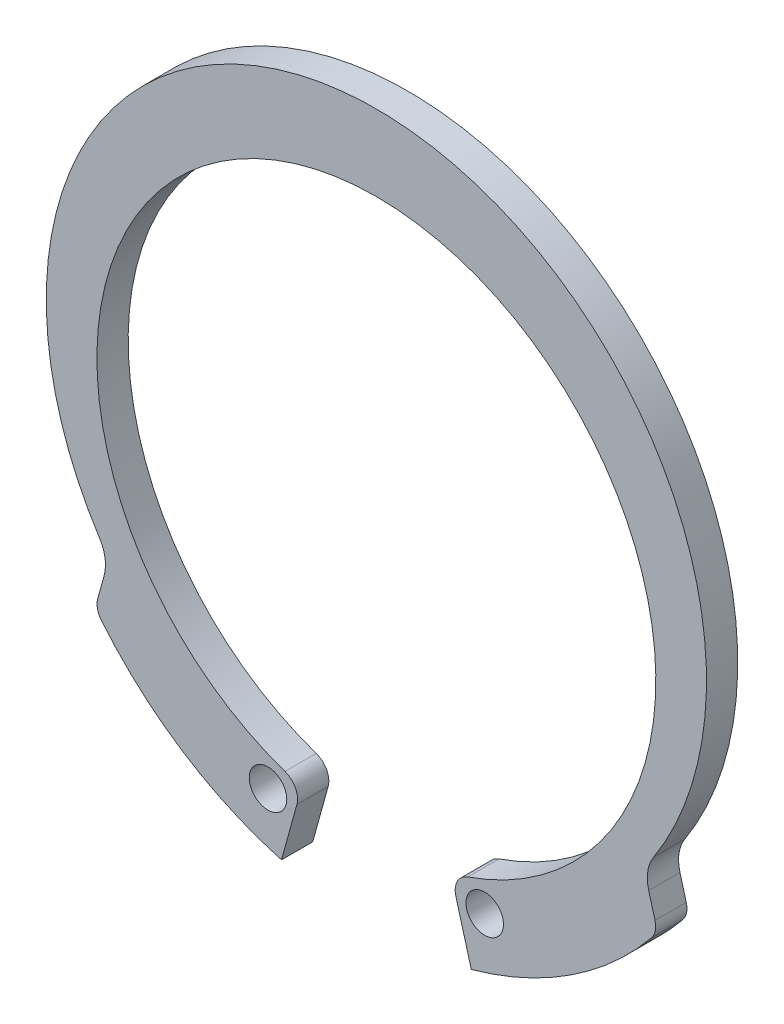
ISO-10303-21;
HEADER;
FILE_DESCRIPTION(('STEP AP214'),'2;1');
FILE_NAME('part.step','',(''),(''),'','','');
FILE_SCHEMA(('AUTOMOTIVE_DESIGN { 1 0 10303 214 1 1 1 1 }'));
ENDSEC;
DATA;
#1=APPLICATION_CONTEXT('core data for automotive mechanical design processes');
#2=APPLICATION_PROTOCOL_DEFINITION('international standard','automotive_design',2000,#1);
#3=PRODUCT_CONTEXT('',#1,'mechanical');
#4=PRODUCT('Part','Part','',(#3));
#5=PRODUCT_RELATED_PRODUCT_CATEGORY('part','',(#4));
#6=PRODUCT_DEFINITION_FORMATION('','',#4);
#7=PRODUCT_DEFINITION_CONTEXT('part definition',#1,'design');
#8=PRODUCT_DEFINITION('design','',#6,#7);
#9=PRODUCT_DEFINITION_SHAPE('','',#8);
#10=(LENGTH_UNIT() NAMED_UNIT(*) SI_UNIT(.MILLI.,.METRE.));
#11=(NAMED_UNIT(*) PLANE_ANGLE_UNIT() SI_UNIT($,.RADIAN.));
#12=(NAMED_UNIT(*) SI_UNIT($,.STERADIAN.) SOLID_ANGLE_UNIT());
#13=UNCERTAINTY_MEASURE_WITH_UNIT(LENGTH_MEASURE(1.E-05),#10,'distance_accuracy_value','');
#14=(GEOMETRIC_REPRESENTATION_CONTEXT(3) GLOBAL_UNCERTAINTY_ASSIGNED_CONTEXT((#13)) GLOBAL_UNIT_ASSIGNED_CONTEXT((#10,
#11,#12)) REPRESENTATION_CONTEXT('',''));
#15=CARTESIAN_POINT('',(0.,0.,0.));
#16=DIRECTION('',(0.,0.,1.));
#17=DIRECTION('',(1.,0.,0.));
#18=AXIS2_PLACEMENT_3D('',#15,#16,#17);
#19=CARTESIAN_POINT('',(0.,0.,-0.888999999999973));
#20=DIRECTION('',(0.,0.,1.));
#21=DIRECTION('',(1.,0.,0.));
#22=AXIS2_PLACEMENT_3D('',#19,#20,#21);
#23=CYLINDRICAL_SURFACE('',#22,10.1092);
#24=CARTESIAN_POINT('',(0.,0.,0.));
#25=DIRECTION('',(0.,0.,1.));
#26=DIRECTION('',(1.,0.,0.));
#27=AXIS2_PLACEMENT_3D('',#24,#25,#26);
#28=CIRCLE('',#27,10.1092);
#29=CARTESIAN_POINT('',(-7.82591514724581,-6.39929501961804,-1.0547118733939E-12));
#30=VERTEX_POINT('',#29);
#31=CARTESIAN_POINT('',(-2.69985738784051,-9.74200670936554,0.));
#32=VERTEX_POINT('',#31);
#33=EDGE_CURVE('E167',#30,#32,#28,.T.);
#34=ORIENTED_EDGE('',*,*,#33,.F.);
#35=DIRECTION('',(0.,0.,1.));
#36=VECTOR('',#35,1.);
#37=CARTESIAN_POINT('',(-7.8259151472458,-6.39929501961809,-0.889000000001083));
#38=LINE('',#37,#36);
#39=CARTESIAN_POINT('',(-7.8259151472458,-6.39929501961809,-0.889000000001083));
#40=VERTEX_POINT('',#39);
#41=EDGE_CURVE('E11',#40,#30,#38,.T.);
#42=ORIENTED_EDGE('',*,*,#41,.F.);
#43=CARTESIAN_POINT('',(0.,0.,-0.888999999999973));
#44=DIRECTION('',(0.,0.,1.));
#45=DIRECTION('',(1.,0.,0.));
#46=AXIS2_PLACEMENT_3D('',#43,#44,#45);
#47=CIRCLE('',#46,10.1092);
#48=CARTESIAN_POINT('',(-2.69985738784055,-9.74200670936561,-0.889000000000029));
#49=VERTEX_POINT('',#48);
#50=EDGE_CURVE('E206',#40,#49,#47,.T.);
#51=ORIENTED_EDGE('',*,*,#50,.T.);
#52=DIRECTION('',(0.,0.,1.));
#53=VECTOR('',#52,1.);
#54=CARTESIAN_POINT('',(-2.69985738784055,-9.74200670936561,-0.889000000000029));
#55=LINE('',#54,#53);
#56=EDGE_CURVE('E37',#49,#32,#55,.T.);
#57=ORIENTED_EDGE('',*,*,#56,.T.);
#58=EDGE_LOOP('',(#34,#42,#51,#57));
#59=FACE_BOUND('',#58,.T.);
#60=ADVANCED_FACE('F34',(#59),#23,.T.);
#61=CARTESIAN_POINT('',(-7.41298997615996,-6.06164377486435,-0.889000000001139));
#62=DIRECTION('',(0.,0.,1.));
#63=DIRECTION('',(1.,0.,0.));
#64=AXIS2_PLACEMENT_3D('',#61,#62,#63);
#65=CYLINDRICAL_SURFACE('',#64,0.533400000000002);
#66=CARTESIAN_POINT('',(-7.41298997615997,-6.06164377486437,-1.0547118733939E-12));
#67=DIRECTION('',(0.,0.,1.));
#68=DIRECTION('',(-1.,0.,0.));
#69=AXIS2_PLACEMENT_3D('',#66,#67,#68);
#70=CIRCLE('',#69,0.533400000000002);
#71=CARTESIAN_POINT('',(-7.92701545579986,-5.91918898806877,-1.0547118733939E-12));
#72=VERTEX_POINT('',#71);
#73=EDGE_CURVE('E204',#72,#30,#70,.T.);
#74=ORIENTED_EDGE('',*,*,#73,.F.);
#75=DIRECTION('',(0.,0.,1.));
#76=VECTOR('',#75,1.);
#77=CARTESIAN_POINT('',(-7.92701545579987,-5.91918898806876,-0.889000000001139));
#78=LINE('',#77,#76);
#79=CARTESIAN_POINT('',(-7.92701545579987,-5.91918898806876,-0.889000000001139));
#80=VERTEX_POINT('',#79);
#81=EDGE_CURVE('E43',#80,#72,#78,.T.);
#82=ORIENTED_EDGE('',*,*,#81,.F.);
#83=CARTESIAN_POINT('',(-7.41298997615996,-6.06164377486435,-0.889000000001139));
#84=DIRECTION('',(0.,0.,1.));
#85=DIRECTION('',(-1.,0.,0.));
#86=AXIS2_PLACEMENT_3D('',#83,#84,#85);
#87=CIRCLE('',#86,0.533400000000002);
#88=EDGE_CURVE('E157',#80,#40,#87,.T.);
#89=ORIENTED_EDGE('',*,*,#88,.T.);
#90=ORIENTED_EDGE('',*,*,#41,.T.);
#91=EDGE_LOOP('',(#74,#82,#89,#90));
#92=FACE_BOUND('',#91,.T.);
#93=ADVANCED_FACE('F230',(#92),#65,.T.);
#94=CARTESIAN_POINT('',(-7.7472865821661,-5.27066588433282,-0.889000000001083));
#95=DIRECTION('',(-0.963677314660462,0.26706934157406,0.));
#96=DIRECTION('',(-0.26706934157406,-0.963677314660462,0.));
#97=AXIS2_PLACEMENT_3D('',#94,#95,#96);
#98=PLANE('',#97);
#99=DIRECTION('',(-0.26706934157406,-0.963677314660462,0.));
#100=VECTOR('',#99,1.);
#101=CARTESIAN_POINT('',(-7.74728658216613,-5.27066588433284,-9.99200722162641E-13));
#102=LINE('',#101,#100);
#103=CARTESIAN_POINT('',(-7.74728658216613,-5.27066588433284,-9.99200722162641E-13));
#104=VERTEX_POINT('',#103);
#105=EDGE_CURVE('E144',#104,#72,#102,.T.);
#106=ORIENTED_EDGE('',*,*,#105,.F.);
#107=DIRECTION('',(0.,0.,1.));
#108=VECTOR('',#107,1.);
#109=CARTESIAN_POINT('',(-7.7472865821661,-5.27066588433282,-0.889000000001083));
#110=LINE('',#109,#108);
#111=CARTESIAN_POINT('',(-7.7472865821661,-5.27066588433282,-0.889000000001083));
#112=VERTEX_POINT('',#111);
#113=EDGE_CURVE('E139',#112,#104,#110,.T.);
#114=ORIENTED_EDGE('',*,*,#113,.F.);
#115=DIRECTION('',(-0.26706934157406,-0.963677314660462,0.));
#116=VECTOR('',#115,1.);
#117=CARTESIAN_POINT('',(-7.7472865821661,-5.27066588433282,-0.889000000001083));
#118=LINE('',#117,#116);
#119=EDGE_CURVE('E142',#112,#80,#118,.T.);
#120=ORIENTED_EDGE('',*,*,#119,.T.);
#121=ORIENTED_EDGE('',*,*,#81,.T.);
#122=EDGE_LOOP('',(#106,#114,#120,#121));
#123=FACE_BOUND('',#122,.T.);
#124=ADVANCED_FACE('F141',(#123),#98,.T.);
#125=CARTESIAN_POINT('',(-8.79772647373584,-4.97955153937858,-0.889000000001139));
#126=DIRECTION('',(0.,0.,1.));
#127=DIRECTION('',(1.,0.,0.));
#128=AXIS2_PLACEMENT_3D('',#125,#126,#127);
#129=CYLINDRICAL_SURFACE('',#128,1.09003281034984);
#130=CARTESIAN_POINT('',(-8.79772647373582,-4.97955153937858,-1.0547118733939E-12));
#131=DIRECTION('',(0.,0.,-1.));
#132=DIRECTION('',(1.,0.,0.));
#133=AXIS2_PLACEMENT_3D('',#130,#131,#132);
#134=CIRCLE('',#133,1.09003281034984);
#135=CARTESIAN_POINT('',(-7.88279161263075,-4.38704354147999,-1.11022302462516E-12));
#136=VERTEX_POINT('',#135);
#137=EDGE_CURVE('E201',#136,#104,#134,.T.);
#138=ORIENTED_EDGE('',*,*,#137,.F.);
#139=DIRECTION('',(0.,0.,1.));
#140=VECTOR('',#139,1.);
#141=CARTESIAN_POINT('',(-7.88279161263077,-4.38704354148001,-0.889000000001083));
#142=LINE('',#141,#140);
#143=CARTESIAN_POINT('',(-7.88279161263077,-4.38704354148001,-0.889000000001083));
#144=VERTEX_POINT('',#143);
#145=EDGE_CURVE('E149',#144,#136,#142,.T.);
#146=ORIENTED_EDGE('',*,*,#145,.F.);
#147=CARTESIAN_POINT('',(-8.79772647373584,-4.97955153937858,-0.889000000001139));
#148=DIRECTION('',(0.,0.,-1.));
#149=DIRECTION('',(1.,0.,0.));
#150=AXIS2_PLACEMENT_3D('',#147,#148,#149);
#151=CIRCLE('',#150,1.09003281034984);
#152=EDGE_CURVE('E155',#144,#112,#151,.T.);
#153=ORIENTED_EDGE('',*,*,#152,.T.);
#154=ORIENTED_EDGE('',*,*,#113,.T.);
#155=EDGE_LOOP('',(#138,#146,#153,#154));
#156=FACE_BOUND('',#155,.T.);
#157=ADVANCED_FACE('F159',(#156),#129,.F.);
#158=CARTESIAN_POINT('',(0.,0.717819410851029,-0.889000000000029));
#159=DIRECTION('',(0.,0.,1.));
#160=DIRECTION('',(1.,0.,0.));
#161=AXIS2_PLACEMENT_3D('',#158,#159,#160);
#162=CYLINDRICAL_SURFACE('',#161,9.39138058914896);
#163=CARTESIAN_POINT('',(0.,0.717819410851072,0.));
#164=DIRECTION('',(0.,0.,1.));
#165=DIRECTION('',(1.,0.,0.));
#166=AXIS2_PLACEMENT_3D('',#163,#164,#165);
#167=CIRCLE('',#166,9.39138058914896);
#168=CARTESIAN_POINT('',(7.88279161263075,-4.38704354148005,0.));
#169=VERTEX_POINT('',#168);
#170=EDGE_CURVE('E198',#169,#136,#167,.T.);
#171=ORIENTED_EDGE('',*,*,#170,.F.);
#172=DIRECTION('',(0.,0.,1.));
#173=VECTOR('',#172,1.);
#174=CARTESIAN_POINT('',(7.88279161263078,-4.38704354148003,-0.889000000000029));
#175=LINE('',#174,#173);
#176=CARTESIAN_POINT('',(7.88279161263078,-4.38704354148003,-0.889000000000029));
#177=VERTEX_POINT('',#176);
#178=EDGE_CURVE('E210',#177,#169,#175,.T.);
#179=ORIENTED_EDGE('',*,*,#178,.F.);
#180=CARTESIAN_POINT('',(0.,0.717819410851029,-0.889000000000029));
#181=DIRECTION('',(0.,0.,1.));
#182=DIRECTION('',(1.,0.,0.));
#183=AXIS2_PLACEMENT_3D('',#180,#181,#182);
#184=CIRCLE('',#183,9.39138058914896);
#185=EDGE_CURVE('E160',#177,#144,#184,.T.);
#186=ORIENTED_EDGE('',*,*,#185,.T.);
#187=ORIENTED_EDGE('',*,*,#145,.T.);
#188=EDGE_LOOP('',(#171,#179,#186,#187));
#189=FACE_BOUND('',#188,.T.);
#190=ADVANCED_FACE('F243',(#189),#162,.T.);
#191=CARTESIAN_POINT('',(8.79772647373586,-4.9795515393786,-0.888999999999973));
#192=DIRECTION('',(0.,0.,1.));
#193=DIRECTION('',(1.,0.,0.));
#194=AXIS2_PLACEMENT_3D('',#191,#192,#193);
#195=CYLINDRICAL_SURFACE('',#194,1.09003281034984);
#196=CARTESIAN_POINT('',(8.79772647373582,-4.97955153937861,0.));
#197=DIRECTION('',(0.,0.,-1.));
#198=DIRECTION('',(1.,0.,0.));
#199=AXIS2_PLACEMENT_3D('',#196,#197,#198);
#200=CIRCLE('',#199,1.09003281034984);
#201=CARTESIAN_POINT('',(7.74728658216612,-5.27066588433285,0.));
#202=VERTEX_POINT('',#201);
#203=EDGE_CURVE('E195',#202,#169,#200,.T.);
#204=ORIENTED_EDGE('',*,*,#203,.F.);
#205=DIRECTION('',(0.,0.,1.));
#206=VECTOR('',#205,1.);
#207=CARTESIAN_POINT('',(7.74728658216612,-5.27066588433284,-0.889000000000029));
#208=LINE('',#207,#206);
#209=CARTESIAN_POINT('',(7.74728658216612,-5.27066588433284,-0.889000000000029));
#210=VERTEX_POINT('',#209);
#211=EDGE_CURVE('E212',#210,#202,#208,.T.);
#212=ORIENTED_EDGE('',*,*,#211,.F.);
#213=CARTESIAN_POINT('',(8.79772647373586,-4.9795515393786,-0.888999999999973));
#214=DIRECTION('',(0.,0.,-1.));
#215=DIRECTION('',(1.,0.,0.));
#216=AXIS2_PLACEMENT_3D('',#213,#214,#215);
#217=CIRCLE('',#216,1.09003281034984);
#218=EDGE_CURVE('E162',#210,#177,#217,.T.);
#219=ORIENTED_EDGE('',*,*,#218,.T.);
#220=ORIENTED_EDGE('',*,*,#178,.T.);
#221=EDGE_LOOP('',(#204,#212,#219,#220));
#222=FACE_BOUND('',#221,.T.);
#223=ADVANCED_FACE('F246',(#222),#195,.F.);
#224=CARTESIAN_POINT('',(7.74728658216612,-5.27066588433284,-0.889000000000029));
#225=DIRECTION('',(0.963677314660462,0.26706934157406,0.));
#226=DIRECTION('',(-0.26706934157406,0.963677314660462,0.));
#227=AXIS2_PLACEMENT_3D('',#224,#225,#226);
#228=PLANE('',#227);
#229=DIRECTION('',(-0.26706934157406,0.963677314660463,0.));
#230=VECTOR('',#229,1.);
#231=CARTESIAN_POINT('',(7.74728658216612,-5.27066588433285,0.));
#232=LINE('',#231,#230);
#233=CARTESIAN_POINT('',(7.92701545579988,-5.91918898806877,0.));
#234=VERTEX_POINT('',#233);
#235=EDGE_CURVE('E192',#234,#202,#232,.T.);
#236=ORIENTED_EDGE('',*,*,#235,.F.);
#237=DIRECTION('',(0.,0.,1.));
#238=VECTOR('',#237,1.);
#239=CARTESIAN_POINT('',(7.92701545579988,-5.91918898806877,-0.889000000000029));
#240=LINE('',#239,#238);
#241=CARTESIAN_POINT('',(7.92701545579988,-5.91918898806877,-0.889000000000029));
#242=VERTEX_POINT('',#241);
#243=EDGE_CURVE('E214',#242,#234,#240,.T.);
#244=ORIENTED_EDGE('',*,*,#243,.F.);
#245=DIRECTION('',(-0.26706934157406,0.963677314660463,0.));
#246=VECTOR('',#245,1.);
#247=CARTESIAN_POINT('',(7.74728658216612,-5.27066588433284,-0.889000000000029));
#248=LINE('',#247,#246);
#249=EDGE_CURVE('E334',#242,#210,#248,.T.);
#250=ORIENTED_EDGE('',*,*,#249,.T.);
#251=ORIENTED_EDGE('',*,*,#211,.T.);
#252=EDGE_LOOP('',(#236,#244,#250,#251));
#253=FACE_BOUND('',#252,.T.);
#254=ADVANCED_FACE('F250',(#253),#228,.T.);
#255=CARTESIAN_POINT('',(7.41298997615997,-6.06164377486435,-0.889000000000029));
#256=DIRECTION('',(0.,0.,1.));
#257=DIRECTION('',(1.,0.,0.));
#258=AXIS2_PLACEMENT_3D('',#255,#256,#257);
#259=CYLINDRICAL_SURFACE('',#258,0.533400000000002);
#260=CARTESIAN_POINT('',(7.41298997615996,-6.06164377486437,0.));
#261=DIRECTION('',(0.,0.,1.));
#262=DIRECTION('',(1.,0.,0.));
#263=AXIS2_PLACEMENT_3D('',#260,#261,#262);
#264=CIRCLE('',#263,0.533400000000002);
#265=CARTESIAN_POINT('',(7.82591514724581,-6.3992950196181,0.));
#266=VERTEX_POINT('',#265);
#267=EDGE_CURVE('E189',#266,#234,#264,.T.);
#268=ORIENTED_EDGE('',*,*,#267,.F.);
#269=DIRECTION('',(0.,0.,1.));
#270=VECTOR('',#269,1.);
#271=CARTESIAN_POINT('',(7.8259151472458,-6.39929501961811,-0.889000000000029));
#272=LINE('',#271,#270);
#273=CARTESIAN_POINT('',(7.8259151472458,-6.39929501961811,-0.889000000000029));
#274=VERTEX_POINT('',#273);
#275=EDGE_CURVE('E216',#274,#266,#272,.T.);
#276=ORIENTED_EDGE('',*,*,#275,.F.);
#277=CARTESIAN_POINT('',(7.41298997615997,-6.06164377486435,-0.889000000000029));
#278=DIRECTION('',(0.,0.,1.));
#279=DIRECTION('',(1.,0.,0.));
#280=AXIS2_PLACEMENT_3D('',#277,#278,#279);
#281=CIRCLE('',#280,0.533400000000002);
#282=EDGE_CURVE('E331',#274,#242,#281,.T.);
#283=ORIENTED_EDGE('',*,*,#282,.T.);
#284=ORIENTED_EDGE('',*,*,#243,.T.);
#285=EDGE_LOOP('',(#268,#276,#283,#284));
#286=FACE_BOUND('',#285,.T.);
#287=ADVANCED_FACE('F254',(#286),#259,.T.);
#288=CARTESIAN_POINT('',(0.,0.,-0.888999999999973));
#289=DIRECTION('',(0.,0.,1.));
#290=DIRECTION('',(1.,0.,0.));
#291=AXIS2_PLACEMENT_3D('',#288,#289,#290);
#292=CYLINDRICAL_SURFACE('',#291,10.1092);
#293=CARTESIAN_POINT('',(0.,0.,0.));
#294=DIRECTION('',(0.,0.,1.));
#295=DIRECTION('',(1.,0.,0.));
#296=AXIS2_PLACEMENT_3D('',#293,#294,#295);
#297=CIRCLE('',#296,10.1092);
#298=CARTESIAN_POINT('',(2.6998573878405,-9.74200670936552,0.));
#299=VERTEX_POINT('',#298);
#300=EDGE_CURVE('E186',#299,#266,#297,.T.);
#301=ORIENTED_EDGE('',*,*,#300,.F.);
#302=DIRECTION('',(0.,0.,1.));
#303=VECTOR('',#302,1.);
#304=CARTESIAN_POINT('',(2.69985738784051,-9.74200670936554,-0.888999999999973));
#305=LINE('',#304,#303);
#306=CARTESIAN_POINT('',(2.69985738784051,-9.74200670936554,-0.888999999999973));
#307=VERTEX_POINT('',#306);
#308=EDGE_CURVE('E218',#307,#299,#305,.T.);
#309=ORIENTED_EDGE('',*,*,#308,.F.);
#310=CARTESIAN_POINT('',(0.,0.,-0.888999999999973));
#311=DIRECTION('',(0.,0.,1.));
#312=DIRECTION('',(1.,0.,0.));
#313=AXIS2_PLACEMENT_3D('',#310,#311,#312);
#314=CIRCLE('',#313,10.1092);
#315=EDGE_CURVE('E328',#307,#274,#314,.T.);
#316=ORIENTED_EDGE('',*,*,#315,.T.);
#317=ORIENTED_EDGE('',*,*,#275,.T.);
#318=EDGE_LOOP('',(#301,#309,#316,#317));
#319=FACE_BOUND('',#318,.T.);
#320=ADVANCED_FACE('F258',(#319),#292,.T.);
#321=CARTESIAN_POINT('',(2.2612266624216,-8.15927738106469,-0.888999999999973));
#322=DIRECTION('',(-0.963677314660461,-0.267069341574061,0.));
#323=DIRECTION('',(0.267069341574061,-0.963677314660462,0.));
#324=AXIS2_PLACEMENT_3D('',#321,#322,#323);
#325=PLANE('',#324);
#326=DIRECTION('',(0.267069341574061,-0.963677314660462,0.));
#327=VECTOR('',#326,1.);
#328=CARTESIAN_POINT('',(2.26122666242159,-8.1592773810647,0.));
#329=LINE('',#328,#327);
#330=CARTESIAN_POINT('',(2.26122666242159,-8.1592773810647,0.));
#331=VERTEX_POINT('',#330);
#332=EDGE_CURVE('E183',#331,#299,#329,.T.);
#333=ORIENTED_EDGE('',*,*,#332,.F.);
#334=DIRECTION('',(0.,0.,1.));
#335=VECTOR('',#334,1.);
#336=CARTESIAN_POINT('',(2.2612266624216,-8.15927738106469,-0.888999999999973));
#337=LINE('',#336,#335);
#338=CARTESIAN_POINT('',(2.2612266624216,-8.15927738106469,-0.888999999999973));
#339=VERTEX_POINT('',#338);
#340=EDGE_CURVE('E220',#339,#331,#337,.T.);
#341=ORIENTED_EDGE('',*,*,#340,.F.);
#342=DIRECTION('',(0.267069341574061,-0.963677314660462,0.));
#343=VECTOR('',#342,1.);
#344=CARTESIAN_POINT('',(2.2612266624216,-8.15927738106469,-0.888999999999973));
#345=LINE('',#344,#343);
#346=EDGE_CURVE('E325',#339,#307,#345,.T.);
#347=ORIENTED_EDGE('',*,*,#346,.T.);
#348=ORIENTED_EDGE('',*,*,#308,.T.);
#349=EDGE_LOOP('',(#333,#341,#347,#348));
#350=FACE_BOUND('',#349,.T.);
#351=ADVANCED_FACE('F262',(#350),#325,.T.);
#352=CARTESIAN_POINT('',(2.77525214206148,-8.01682259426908,-0.888999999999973));
#353=DIRECTION('',(0.,0.,1.));
#354=DIRECTION('',(1.,0.,0.));
#355=AXIS2_PLACEMENT_3D('',#352,#353,#354);
#356=CYLINDRICAL_SURFACE('',#355,0.5334);
#357=CARTESIAN_POINT('',(2.7752521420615,-8.01682259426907,0.));
#358=DIRECTION('',(0.,0.,1.));
#359=DIRECTION('',(-1.,0.,0.));
#360=AXIS2_PLACEMENT_3D('',#357,#358,#359);
#361=CIRCLE('',#360,0.5334);
#362=CARTESIAN_POINT('',(2.60076024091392,-7.51277087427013,0.));
#363=VERTEX_POINT('',#362);
#364=EDGE_CURVE('E180',#363,#331,#361,.T.);
#365=ORIENTED_EDGE('',*,*,#364,.F.);
#366=DIRECTION('',(0.,0.,1.));
#367=VECTOR('',#366,1.);
#368=CARTESIAN_POINT('',(2.60076024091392,-7.51277087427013,-0.888999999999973));
#369=LINE('',#368,#367);
#370=CARTESIAN_POINT('',(2.60076024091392,-7.51277087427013,-0.888999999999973));
#371=VERTEX_POINT('',#370);
#372=EDGE_CURVE('E222',#371,#363,#369,.T.);
#373=ORIENTED_EDGE('',*,*,#372,.F.);
#374=CARTESIAN_POINT('',(2.77525214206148,-8.01682259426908,-0.888999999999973));
#375=DIRECTION('',(0.,0.,1.));
#376=DIRECTION('',(-1.,0.,0.));
#377=AXIS2_PLACEMENT_3D('',#374,#375,#376);
#378=CIRCLE('',#377,0.5334);
#379=EDGE_CURVE('E322',#371,#339,#378,.T.);
#380=ORIENTED_EDGE('',*,*,#379,.T.);
#381=ORIENTED_EDGE('',*,*,#340,.T.);
#382=EDGE_LOOP('',(#365,#373,#380,#381));
#383=FACE_BOUND('',#382,.T.);
#384=ADVANCED_FACE('F266',(#383),#356,.T.);
#385=CARTESIAN_POINT('',(0.,0.,-0.888999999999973));
#386=DIRECTION('',(0.,0.,1.));
#387=DIRECTION('',(1.,0.,0.));
#388=AXIS2_PLACEMENT_3D('',#385,#386,#387);
#389=CYLINDRICAL_SURFACE('',#388,7.9502);
#390=CARTESIAN_POINT('',(0.,0.,0.));
#391=DIRECTION('',(0.,0.,-1.));
#392=DIRECTION('',(1.,0.,0.));
#393=AXIS2_PLACEMENT_3D('',#390,#391,#392);
#394=CIRCLE('',#393,7.9502);
#395=CARTESIAN_POINT('',(-2.60076024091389,-7.51277087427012,0.));
#396=VERTEX_POINT('',#395);
#397=EDGE_CURVE('E177',#396,#363,#394,.T.);
#398=ORIENTED_EDGE('',*,*,#397,.F.);
#399=DIRECTION('',(0.,0.,1.));
#400=VECTOR('',#399,1.);
#401=CARTESIAN_POINT('',(-2.60076024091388,-7.51277087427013,-0.888999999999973));
#402=LINE('',#401,#400);
#403=CARTESIAN_POINT('',(-2.60076024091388,-7.51277087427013,-0.888999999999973));
#404=VERTEX_POINT('',#403);
#405=EDGE_CURVE('E224',#404,#396,#402,.T.);
#406=ORIENTED_EDGE('',*,*,#405,.F.);
#407=CARTESIAN_POINT('',(0.,0.,-0.888999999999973));
#408=DIRECTION('',(0.,0.,-1.));
#409=DIRECTION('',(1.,0.,0.));
#410=AXIS2_PLACEMENT_3D('',#407,#408,#409);
#411=CIRCLE('',#410,7.9502);
#412=EDGE_CURVE('E319',#404,#371,#411,.T.);
#413=ORIENTED_EDGE('',*,*,#412,.T.);
#414=ORIENTED_EDGE('',*,*,#372,.T.);
#415=EDGE_LOOP('',(#398,#406,#413,#414));
#416=FACE_BOUND('',#415,.T.);
#417=ADVANCED_FACE('F270',(#416),#389,.F.);
#418=CARTESIAN_POINT('',(-2.77525214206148,-8.01682259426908,-0.888999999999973));
#419=DIRECTION('',(0.,0.,1.));
#420=DIRECTION('',(1.,0.,0.));
#421=AXIS2_PLACEMENT_3D('',#418,#419,#420);
#422=CYLINDRICAL_SURFACE('',#421,0.5334);
#423=CARTESIAN_POINT('',(-2.77525214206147,-8.01682259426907,0.));
#424=DIRECTION('',(0.,0.,1.));
#425=DIRECTION('',(1.,0.,0.));
#426=AXIS2_PLACEMENT_3D('',#423,#424,#425);
#427=CIRCLE('',#426,0.5334);
#428=CARTESIAN_POINT('',(-2.2612266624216,-8.15927738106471,0.));
#429=VERTEX_POINT('',#428);
#430=EDGE_CURVE('E174',#429,#396,#427,.T.);
#431=ORIENTED_EDGE('',*,*,#430,.F.);
#432=DIRECTION('',(0.,0.,1.));
#433=VECTOR('',#432,1.);
#434=CARTESIAN_POINT('',(-2.26122666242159,-8.1592773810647,-0.888999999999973));
#435=LINE('',#434,#433);
#436=CARTESIAN_POINT('',(-2.26122666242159,-8.1592773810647,-0.888999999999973));
#437=VERTEX_POINT('',#436);
#438=EDGE_CURVE('E225',#437,#429,#435,.T.);
#439=ORIENTED_EDGE('',*,*,#438,.F.);
#440=CARTESIAN_POINT('',(-2.77525214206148,-8.01682259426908,-0.888999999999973));
#441=DIRECTION('',(0.,0.,1.));
#442=DIRECTION('',(1.,0.,0.));
#443=AXIS2_PLACEMENT_3D('',#440,#441,#442);
#444=CIRCLE('',#443,0.5334);
#445=EDGE_CURVE('E316',#437,#404,#444,.T.);
#446=ORIENTED_EDGE('',*,*,#445,.T.);
#447=ORIENTED_EDGE('',*,*,#405,.T.);
#448=EDGE_LOOP('',(#431,#439,#446,#447));
#449=FACE_BOUND('',#448,.T.);
#450=ADVANCED_FACE('F274',(#449),#422,.T.);
#451=CARTESIAN_POINT('',(-2.26122666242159,-8.1592773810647,-0.888999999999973));
#452=DIRECTION('',(0.963677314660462,-0.267069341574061,0.));
#453=DIRECTION('',(0.267069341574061,0.963677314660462,0.));
#454=AXIS2_PLACEMENT_3D('',#451,#452,#453);
#455=PLANE('',#454);
#456=DIRECTION('',(0.267069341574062,0.963677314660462,0.));
#457=VECTOR('',#456,1.);
#458=CARTESIAN_POINT('',(-2.2612266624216,-8.15927738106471,0.));
#459=LINE('',#458,#457);
#460=EDGE_CURVE('E170',#32,#429,#459,.T.);
#461=ORIENTED_EDGE('',*,*,#460,.F.);
#462=ORIENTED_EDGE('',*,*,#56,.F.);
#463=DIRECTION('',(0.267069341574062,0.963677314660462,0.));
#464=VECTOR('',#463,1.);
#465=CARTESIAN_POINT('',(-2.26122666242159,-8.1592773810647,-0.888999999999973));
#466=LINE('',#465,#464);
#467=EDGE_CURVE('E314',#49,#437,#466,.T.);
#468=ORIENTED_EDGE('',*,*,#467,.T.);
#469=ORIENTED_EDGE('',*,*,#438,.T.);
#470=EDGE_LOOP('',(#461,#462,#468,#469));
#471=FACE_BOUND('',#470,.T.);
#472=ADVANCED_FACE('F227',(#471),#455,.T.);
#473=CARTESIAN_POINT('',(0.,0.,-0.888999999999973));
#474=DIRECTION('',(0.,0.,1.));
#475=DIRECTION('',(1.,0.,0.));
#476=AXIS2_PLACEMENT_3D('',#473,#474,#475);
#477=PLANE('',#476);
#478=CARTESIAN_POINT('',(-3.08284998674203,-8.17567671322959,-0.888999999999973));
#479=DIRECTION('',(0.,0.,1.));
#480=DIRECTION('',(1.,0.,0.));
#481=AXIS2_PLACEMENT_3D('',#478,#479,#480);
#482=CIRCLE('',#481,0.533400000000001);
#483=CARTESIAN_POINT('',(-2.54944998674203,-8.17567671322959,-0.888999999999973));
#484=VERTEX_POINT('',#483);
#485=EDGE_CURVE('E301',#484,#484,#482,.T.);
#486=ORIENTED_EDGE('',*,*,#485,.T.);
#487=EDGE_LOOP('',(#486));
#488=FACE_BOUND('',#487,.T.);
#489=CARTESIAN_POINT('',(3.08284998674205,-8.17567671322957,-0.888999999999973));
#490=DIRECTION('',(0.,0.,1.));
#491=DIRECTION('',(1.,0.,0.));
#492=AXIS2_PLACEMENT_3D('',#489,#490,#491);
#493=CIRCLE('',#492,0.533400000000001);
#494=CARTESIAN_POINT('',(3.61624998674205,-8.17567671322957,-0.888999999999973));
#495=VERTEX_POINT('',#494);
#496=EDGE_CURVE('E171',#495,#495,#493,.T.);
#497=ORIENTED_EDGE('',*,*,#496,.T.);
#498=EDGE_LOOP('',(#497));
#499=FACE_BOUND('',#498,.T.);
#500=ORIENTED_EDGE('',*,*,#50,.F.);
#501=ORIENTED_EDGE('',*,*,#88,.F.);
#502=ORIENTED_EDGE('',*,*,#119,.F.);
#503=ORIENTED_EDGE('',*,*,#152,.F.);
#504=ORIENTED_EDGE('',*,*,#185,.F.);
#505=ORIENTED_EDGE('',*,*,#218,.F.);
#506=ORIENTED_EDGE('',*,*,#249,.F.);
#507=ORIENTED_EDGE('',*,*,#282,.F.);
#508=ORIENTED_EDGE('',*,*,#315,.F.);
#509=ORIENTED_EDGE('',*,*,#346,.F.);
#510=ORIENTED_EDGE('',*,*,#379,.F.);
#511=ORIENTED_EDGE('',*,*,#412,.F.);
#512=ORIENTED_EDGE('',*,*,#445,.F.);
#513=ORIENTED_EDGE('',*,*,#467,.F.);
#514=EDGE_LOOP('',(#500,#501,#502,#503,#504,#505,#506,#507,#508,#509,#510,#511,#512,#513));
#515=FACE_BOUND('',#514,.T.);
#516=ADVANCED_FACE('F153',(#488,#499,#515),#477,.F.);
#517=CARTESIAN_POINT('',(0.,0.,0.));
#518=DIRECTION('',(0.,0.,1.));
#519=DIRECTION('',(1.,0.,0.));
#520=AXIS2_PLACEMENT_3D('',#517,#518,#519);
#521=PLANE('',#520);
#522=CARTESIAN_POINT('',(-3.08284998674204,-8.17567671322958,0.));
#523=DIRECTION('',(0.,0.,1.));
#524=DIRECTION('',(1.,0.,0.));
#525=AXIS2_PLACEMENT_3D('',#522,#523,#524);
#526=CIRCLE('',#525,0.533400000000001);
#527=CARTESIAN_POINT('',(-2.54944998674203,-8.17567671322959,0.));
#528=VERTEX_POINT('',#527);
#529=EDGE_CURVE('E304',#528,#528,#526,.T.);
#530=ORIENTED_EDGE('',*,*,#529,.F.);
#531=EDGE_LOOP('',(#530));
#532=FACE_BOUND('',#531,.T.);
#533=CARTESIAN_POINT('',(3.08284998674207,-8.17567671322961,0.));
#534=DIRECTION('',(0.,0.,1.));
#535=DIRECTION('',(1.,0.,0.));
#536=AXIS2_PLACEMENT_3D('',#533,#534,#535);
#537=CIRCLE('',#536,0.533400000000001);
#538=CARTESIAN_POINT('',(3.61624998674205,-8.17567671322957,0.));
#539=VERTEX_POINT('',#538);
#540=EDGE_CURVE('E306',#539,#539,#537,.T.);
#541=ORIENTED_EDGE('',*,*,#540,.F.);
#542=EDGE_LOOP('',(#541));
#543=FACE_BOUND('',#542,.T.);
#544=ORIENTED_EDGE('',*,*,#33,.T.);
#545=ORIENTED_EDGE('',*,*,#460,.T.);
#546=ORIENTED_EDGE('',*,*,#430,.T.);
#547=ORIENTED_EDGE('',*,*,#397,.T.);
#548=ORIENTED_EDGE('',*,*,#364,.T.);
#549=ORIENTED_EDGE('',*,*,#332,.T.);
#550=ORIENTED_EDGE('',*,*,#300,.T.);
#551=ORIENTED_EDGE('',*,*,#267,.T.);
#552=ORIENTED_EDGE('',*,*,#235,.T.);
#553=ORIENTED_EDGE('',*,*,#203,.T.);
#554=ORIENTED_EDGE('',*,*,#170,.T.);
#555=ORIENTED_EDGE('',*,*,#137,.T.);
#556=ORIENTED_EDGE('',*,*,#105,.T.);
#557=ORIENTED_EDGE('',*,*,#73,.T.);
#558=EDGE_LOOP('',(#544,#545,#546,#547,#548,#549,#550,#551,#552,#553,#554,#555,#556,#557));
#559=FACE_BOUND('',#558,.T.);
#560=ADVANCED_FACE('F229',(#532,#543,#559),#521,.T.);
#561=CARTESIAN_POINT('',(3.08284998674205,-8.17567671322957,-0.888999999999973));
#562=DIRECTION('',(0.,0.,1.));
#563=DIRECTION('',(1.,0.,0.));
#564=AXIS2_PLACEMENT_3D('',#561,#562,#563);
#565=CYLINDRICAL_SURFACE('',#564,0.533400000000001);
#566=CARTESIAN_POINT('',(3.61624998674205,-8.17567671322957,-0.888999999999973));
#567=CARTESIAN_POINT('',(3.61624998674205,-8.17567671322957,-0.879739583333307));
#568=CARTESIAN_POINT('',(3.61624998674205,-8.17567671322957,-0.87047916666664));
#569=CARTESIAN_POINT('',(3.61624998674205,-8.17567671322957,-0.851958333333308));
#570=CARTESIAN_POINT('',(3.61624998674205,-8.17567671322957,-0.842697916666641));
#571=CARTESIAN_POINT('',(3.61624998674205,-8.17567671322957,-0.824177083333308));
#572=CARTESIAN_POINT('',(3.61624998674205,-8.17567671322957,-0.814916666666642));
#573=CARTESIAN_POINT('',(3.61624998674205,-8.17567671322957,-0.796395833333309));
#574=CARTESIAN_POINT('',(3.61624998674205,-8.17567671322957,-0.787135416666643));
#575=CARTESIAN_POINT('',(3.61624998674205,-8.17567671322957,-0.76861458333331));
#576=CARTESIAN_POINT('',(3.61624998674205,-8.17567671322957,-0.759354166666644));
#577=CARTESIAN_POINT('',(3.61624998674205,-8.17567671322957,-0.740833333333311));
#578=CARTESIAN_POINT('',(3.61624998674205,-8.17567671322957,-0.731572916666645));
#579=CARTESIAN_POINT('',(3.61624998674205,-8.17567671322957,-0.713052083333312));
#580=CARTESIAN_POINT('',(3.61624998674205,-8.17567671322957,-0.703791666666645));
#581=CARTESIAN_POINT('',(3.61624998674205,-8.17567671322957,-0.685270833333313));
#582=CARTESIAN_POINT('',(3.61624998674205,-8.17567671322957,-0.676010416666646));
#583=CARTESIAN_POINT('',(3.61624998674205,-8.17567671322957,-0.657489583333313));
#584=CARTESIAN_POINT('',(3.61624998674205,-8.17567671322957,-0.648229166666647));
#585=CARTESIAN_POINT('',(3.61624998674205,-8.17567671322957,-0.629708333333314));
#586=CARTESIAN_POINT('',(3.61624998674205,-8.17567671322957,-0.620447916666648));
#587=CARTESIAN_POINT('',(3.61624998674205,-8.17567671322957,-0.601927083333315));
#588=CARTESIAN_POINT('',(3.61624998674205,-8.17567671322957,-0.592666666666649));
#589=CARTESIAN_POINT('',(3.61624998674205,-8.17567671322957,-0.574145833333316));
#590=CARTESIAN_POINT('',(3.61624998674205,-8.17567671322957,-0.56488541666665));
#591=CARTESIAN_POINT('',(3.61624998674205,-8.17567671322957,-0.546364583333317));
#592=CARTESIAN_POINT('',(3.61624998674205,-8.17567671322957,-0.537104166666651));
#593=CARTESIAN_POINT('',(3.61624998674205,-8.17567671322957,-0.518583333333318));
#594=CARTESIAN_POINT('',(3.61624998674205,-8.17567671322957,-0.509322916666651));
#595=CARTESIAN_POINT('',(3.61624998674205,-8.17567671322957,-0.490802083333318));
#596=CARTESIAN_POINT('',(3.61624998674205,-8.17567671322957,-0.481541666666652));
#597=CARTESIAN_POINT('',(3.61624998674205,-8.17567671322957,-0.463020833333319));
#598=CARTESIAN_POINT('',(3.61624998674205,-8.17567671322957,-0.453760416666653));
#599=CARTESIAN_POINT('',(3.61624998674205,-8.17567671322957,-0.43523958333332));
#600=CARTESIAN_POINT('',(3.61624998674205,-8.17567671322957,-0.425979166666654));
#601=CARTESIAN_POINT('',(3.61624998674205,-8.17567671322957,-0.407458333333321));
#602=CARTESIAN_POINT('',(3.61624998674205,-8.17567671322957,-0.398197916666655));
#603=CARTESIAN_POINT('',(3.61624998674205,-8.17567671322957,-0.379677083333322));
#604=CARTESIAN_POINT('',(3.61624998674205,-8.17567671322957,-0.370416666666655));
#605=CARTESIAN_POINT('',(3.61624998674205,-8.17567671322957,-0.351895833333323));
#606=CARTESIAN_POINT('',(3.61624998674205,-8.17567671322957,-0.342635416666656));
#607=CARTESIAN_POINT('',(3.61624998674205,-8.17567671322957,-0.324114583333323));
#608=CARTESIAN_POINT('',(3.61624998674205,-8.17567671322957,-0.314854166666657));
#609=CARTESIAN_POINT('',(3.61624998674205,-8.17567671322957,-0.296333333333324));
#610=CARTESIAN_POINT('',(3.61624998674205,-8.17567671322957,-0.287072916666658));
#611=CARTESIAN_POINT('',(3.61624998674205,-8.17567671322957,-0.268552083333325));
#612=CARTESIAN_POINT('',(3.61624998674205,-8.17567671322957,-0.259291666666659));
#613=CARTESIAN_POINT('',(3.61624998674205,-8.17567671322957,-0.240770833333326));
#614=CARTESIAN_POINT('',(3.61624998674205,-8.17567671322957,-0.23151041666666));
#615=CARTESIAN_POINT('',(3.61624998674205,-8.17567671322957,-0.212989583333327));
#616=CARTESIAN_POINT('',(3.61624998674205,-8.17567671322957,-0.20372916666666));
#617=CARTESIAN_POINT('',(3.61624998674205,-8.17567671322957,-0.185208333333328));
#618=CARTESIAN_POINT('',(3.61624998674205,-8.17567671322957,-0.175947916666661));
#619=CARTESIAN_POINT('',(3.61624998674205,-8.17567671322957,-0.157427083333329));
#620=CARTESIAN_POINT('',(3.61624998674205,-8.17567671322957,-0.148166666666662));
#621=CARTESIAN_POINT('',(3.61624998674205,-8.17567671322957,-0.129645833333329));
#622=CARTESIAN_POINT('',(3.61624998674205,-8.17567671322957,-0.120385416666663));
#623=CARTESIAN_POINT('',(3.61624998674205,-8.17567671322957,-0.10186458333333));
#624=CARTESIAN_POINT('',(3.61624998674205,-8.17567671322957,-0.0926041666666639));
#625=CARTESIAN_POINT('',(3.61624998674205,-8.17567671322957,-0.0740833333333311));
#626=CARTESIAN_POINT('',(3.61624998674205,-8.17567671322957,-0.0648229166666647));
#627=CARTESIAN_POINT('',(3.61624998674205,-8.17567671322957,-0.0463020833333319));
#628=CARTESIAN_POINT('',(3.61624998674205,-8.17567671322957,-0.0370416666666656));
#629=CARTESIAN_POINT('',(3.61624998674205,-8.17567671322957,-0.0185208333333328));
#630=CARTESIAN_POINT('',(3.61624998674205,-8.17567671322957,-0.00926041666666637));
#631=CARTESIAN_POINT('',(3.61624998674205,-8.17567671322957,0.));
#632=B_SPLINE_CURVE_WITH_KNOTS('',3,(#566,#567,#568,#569,#570,#571,#572,#573,#574,#575,#576,
#577,#578,#579,#580,#581,#582,#583,#584,#585,#586,#587,#588,#589,#590,#591,#592,#593,#594,#595,
#596,#597,#598,#599,#600,#601,#602,#603,#604,#605,#606,#607,#608,#609,#610,#611,#612,#613,#614,
#615,#616,#617,#618,#619,#620,#621,#622,#623,#624,#625,#626,#627,#628,#629,#630,#631),
.UNSPECIFIED.,.F.,.F.,(4,2,2,2,2,2,2,2,2,2,2,2,2,2,2,2,2,2,2,2,2,2,2,2,2,2,2,2,2,2,2,2,4),(0.,
0.0277812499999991,0.0555624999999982,0.0833437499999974,0.111124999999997,0.138906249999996,
0.166687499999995,0.194468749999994,0.222249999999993,0.250031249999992,0.277812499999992,
0.305593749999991,0.33337499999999,0.361156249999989,0.388937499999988,0.416718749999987,
0.444499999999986,0.472281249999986,0.500062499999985,0.527843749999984,0.555624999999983,
0.583406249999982,0.611187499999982,0.638968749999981,0.66674999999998,0.694531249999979,
0.722312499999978,0.750093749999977,0.777874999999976,0.805656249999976,0.833437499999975,
0.861218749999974,0.888999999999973),.UNSPECIFIED.);
#633=EDGE_CURVE('BSEAM286',#495,#539,#632,.T.);
#634=ORIENTED_EDGE('',*,*,#496,.F.);
#635=ORIENTED_EDGE('',*,*,#540,.T.);
#636=ORIENTED_EDGE('',*,*,#633,.T.);
#637=ORIENTED_EDGE('',*,*,#633,.F.);
#638=EDGE_LOOP('',(#634,#636,#635,#637));
#639=FACE_BOUND('',#638,.T.);
#640=ADVANCED_FACE('F286',(#639),#565,.F.);
#641=CARTESIAN_POINT('',(-3.08284998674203,-8.17567671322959,-0.888999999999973));
#642=DIRECTION('',(0.,0.,1.));
#643=DIRECTION('',(1.,0.,0.));
#644=AXIS2_PLACEMENT_3D('',#641,#642,#643);
#645=CYLINDRICAL_SURFACE('',#644,0.533400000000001);
#646=CARTESIAN_POINT('',(-2.54944998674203,-8.17567671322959,-0.888999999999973));
#647=CARTESIAN_POINT('',(-2.54944998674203,-8.17567671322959,-0.879739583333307));
#648=CARTESIAN_POINT('',(-2.54944998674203,-8.17567671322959,-0.87047916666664));
#649=CARTESIAN_POINT('',(-2.54944998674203,-8.17567671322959,-0.851958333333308));
#650=CARTESIAN_POINT('',(-2.54944998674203,-8.17567671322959,-0.842697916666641));
#651=CARTESIAN_POINT('',(-2.54944998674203,-8.17567671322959,-0.824177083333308));
#652=CARTESIAN_POINT('',(-2.54944998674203,-8.17567671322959,-0.814916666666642));
#653=CARTESIAN_POINT('',(-2.54944998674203,-8.17567671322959,-0.796395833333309));
#654=CARTESIAN_POINT('',(-2.54944998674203,-8.17567671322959,-0.787135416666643));
#655=CARTESIAN_POINT('',(-2.54944998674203,-8.17567671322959,-0.76861458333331));
#656=CARTESIAN_POINT('',(-2.54944998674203,-8.17567671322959,-0.759354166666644));
#657=CARTESIAN_POINT('',(-2.54944998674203,-8.17567671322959,-0.740833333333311));
#658=CARTESIAN_POINT('',(-2.54944998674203,-8.17567671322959,-0.731572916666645));
#659=CARTESIAN_POINT('',(-2.54944998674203,-8.17567671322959,-0.713052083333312));
#660=CARTESIAN_POINT('',(-2.54944998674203,-8.17567671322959,-0.703791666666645));
#661=CARTESIAN_POINT('',(-2.54944998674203,-8.17567671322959,-0.685270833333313));
#662=CARTESIAN_POINT('',(-2.54944998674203,-8.17567671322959,-0.676010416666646));
#663=CARTESIAN_POINT('',(-2.54944998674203,-8.17567671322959,-0.657489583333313));
#664=CARTESIAN_POINT('',(-2.54944998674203,-8.17567671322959,-0.648229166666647));
#665=CARTESIAN_POINT('',(-2.54944998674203,-8.17567671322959,-0.629708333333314));
#666=CARTESIAN_POINT('',(-2.54944998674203,-8.17567671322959,-0.620447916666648));
#667=CARTESIAN_POINT('',(-2.54944998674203,-8.17567671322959,-0.601927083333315));
#668=CARTESIAN_POINT('',(-2.54944998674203,-8.17567671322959,-0.592666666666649));
#669=CARTESIAN_POINT('',(-2.54944998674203,-8.17567671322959,-0.574145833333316));
#670=CARTESIAN_POINT('',(-2.54944998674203,-8.17567671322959,-0.56488541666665));
#671=CARTESIAN_POINT('',(-2.54944998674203,-8.17567671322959,-0.546364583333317));
#672=CARTESIAN_POINT('',(-2.54944998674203,-8.17567671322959,-0.537104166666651));
#673=CARTESIAN_POINT('',(-2.54944998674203,-8.17567671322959,-0.518583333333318));
#674=CARTESIAN_POINT('',(-2.54944998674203,-8.17567671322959,-0.509322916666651));
#675=CARTESIAN_POINT('',(-2.54944998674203,-8.17567671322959,-0.490802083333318));
#676=CARTESIAN_POINT('',(-2.54944998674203,-8.17567671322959,-0.481541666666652));
#677=CARTESIAN_POINT('',(-2.54944998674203,-8.17567671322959,-0.463020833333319));
#678=CARTESIAN_POINT('',(-2.54944998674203,-8.17567671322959,-0.453760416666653));
#679=CARTESIAN_POINT('',(-2.54944998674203,-8.17567671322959,-0.43523958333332));
#680=CARTESIAN_POINT('',(-2.54944998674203,-8.17567671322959,-0.425979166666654));
#681=CARTESIAN_POINT('',(-2.54944998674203,-8.17567671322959,-0.407458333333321));
#682=CARTESIAN_POINT('',(-2.54944998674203,-8.17567671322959,-0.398197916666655));
#683=CARTESIAN_POINT('',(-2.54944998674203,-8.17567671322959,-0.379677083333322));
#684=CARTESIAN_POINT('',(-2.54944998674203,-8.17567671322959,-0.370416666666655));
#685=CARTESIAN_POINT('',(-2.54944998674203,-8.17567671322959,-0.351895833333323));
#686=CARTESIAN_POINT('',(-2.54944998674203,-8.17567671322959,-0.342635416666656));
#687=CARTESIAN_POINT('',(-2.54944998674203,-8.17567671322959,-0.324114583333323));
#688=CARTESIAN_POINT('',(-2.54944998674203,-8.17567671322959,-0.314854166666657));
#689=CARTESIAN_POINT('',(-2.54944998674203,-8.17567671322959,-0.296333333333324));
#690=CARTESIAN_POINT('',(-2.54944998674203,-8.17567671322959,-0.287072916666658));
#691=CARTESIAN_POINT('',(-2.54944998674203,-8.17567671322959,-0.268552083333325));
#692=CARTESIAN_POINT('',(-2.54944998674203,-8.17567671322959,-0.259291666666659));
#693=CARTESIAN_POINT('',(-2.54944998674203,-8.17567671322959,-0.240770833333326));
#694=CARTESIAN_POINT('',(-2.54944998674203,-8.17567671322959,-0.23151041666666));
#695=CARTESIAN_POINT('',(-2.54944998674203,-8.17567671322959,-0.212989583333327));
#696=CARTESIAN_POINT('',(-2.54944998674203,-8.17567671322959,-0.20372916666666));
#697=CARTESIAN_POINT('',(-2.54944998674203,-8.17567671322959,-0.185208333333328));
#698=CARTESIAN_POINT('',(-2.54944998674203,-8.17567671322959,-0.175947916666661));
#699=CARTESIAN_POINT('',(-2.54944998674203,-8.17567671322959,-0.157427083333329));
#700=CARTESIAN_POINT('',(-2.54944998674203,-8.17567671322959,-0.148166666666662));
#701=CARTESIAN_POINT('',(-2.54944998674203,-8.17567671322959,-0.129645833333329));
#702=CARTESIAN_POINT('',(-2.54944998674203,-8.17567671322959,-0.120385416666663));
#703=CARTESIAN_POINT('',(-2.54944998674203,-8.17567671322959,-0.10186458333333));
#704=CARTESIAN_POINT('',(-2.54944998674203,-8.17567671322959,-0.0926041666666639));
#705=CARTESIAN_POINT('',(-2.54944998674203,-8.17567671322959,-0.0740833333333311));
#706=CARTESIAN_POINT('',(-2.54944998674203,-8.17567671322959,-0.0648229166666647));
#707=CARTESIAN_POINT('',(-2.54944998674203,-8.17567671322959,-0.0463020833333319));
#708=CARTESIAN_POINT('',(-2.54944998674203,-8.17567671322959,-0.0370416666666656));
#709=CARTESIAN_POINT('',(-2.54944998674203,-8.17567671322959,-0.0185208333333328));
#710=CARTESIAN_POINT('',(-2.54944998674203,-8.17567671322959,-0.00926041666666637));
#711=CARTESIAN_POINT('',(-2.54944998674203,-8.17567671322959,0.));
#712=B_SPLINE_CURVE_WITH_KNOTS('',3,(#646,#647,#648,#649,#650,#651,#652,#653,#654,#655,#656,
#657,#658,#659,#660,#661,#662,#663,#664,#665,#666,#667,#668,#669,#670,#671,#672,#673,#674,#675,
#676,#677,#678,#679,#680,#681,#682,#683,#684,#685,#686,#687,#688,#689,#690,#691,#692,#693,#694,
#695,#696,#697,#698,#699,#700,#701,#702,#703,#704,#705,#706,#707,#708,#709,#710,#711),
.UNSPECIFIED.,.F.,.F.,(4,2,2,2,2,2,2,2,2,2,2,2,2,2,2,2,2,2,2,2,2,2,2,2,2,2,2,2,2,2,2,2,4),(0.,
0.0277812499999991,0.0555624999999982,0.0833437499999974,0.111124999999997,0.138906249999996,
0.166687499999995,0.194468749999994,0.222249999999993,0.250031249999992,0.277812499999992,
0.305593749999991,0.33337499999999,0.361156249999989,0.388937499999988,0.416718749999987,
0.444499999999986,0.472281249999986,0.500062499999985,0.527843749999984,0.555624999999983,
0.583406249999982,0.611187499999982,0.638968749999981,0.66674999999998,0.694531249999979,
0.722312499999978,0.750093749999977,0.777874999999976,0.805656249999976,0.833437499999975,
0.861218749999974,0.888999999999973),.UNSPECIFIED.);
#713=EDGE_CURVE('BSEAM293',#484,#528,#712,.T.);
#714=ORIENTED_EDGE('',*,*,#485,.F.);
#715=ORIENTED_EDGE('',*,*,#529,.T.);
#716=ORIENTED_EDGE('',*,*,#713,.T.);
#717=ORIENTED_EDGE('',*,*,#713,.F.);
#718=EDGE_LOOP('',(#714,#716,#715,#717));
#719=FACE_BOUND('',#718,.T.);
#720=ADVANCED_FACE('F293',(#719),#645,.F.);
#721=CLOSED_SHELL('',(#60,#93,#124,#157,#190,#223,#254,#287,#320,#351,#384,#417,#450,#472,#516,
#560,#640,#720));
#722=MANIFOLD_SOLID_BREP('B2',#721);
#723=ADVANCED_BREP_SHAPE_REPRESENTATION('',(#18,#722),#14);
#724=SHAPE_DEFINITION_REPRESENTATION(#9,#723);
ENDSEC;
END-ISO-10303-21;
